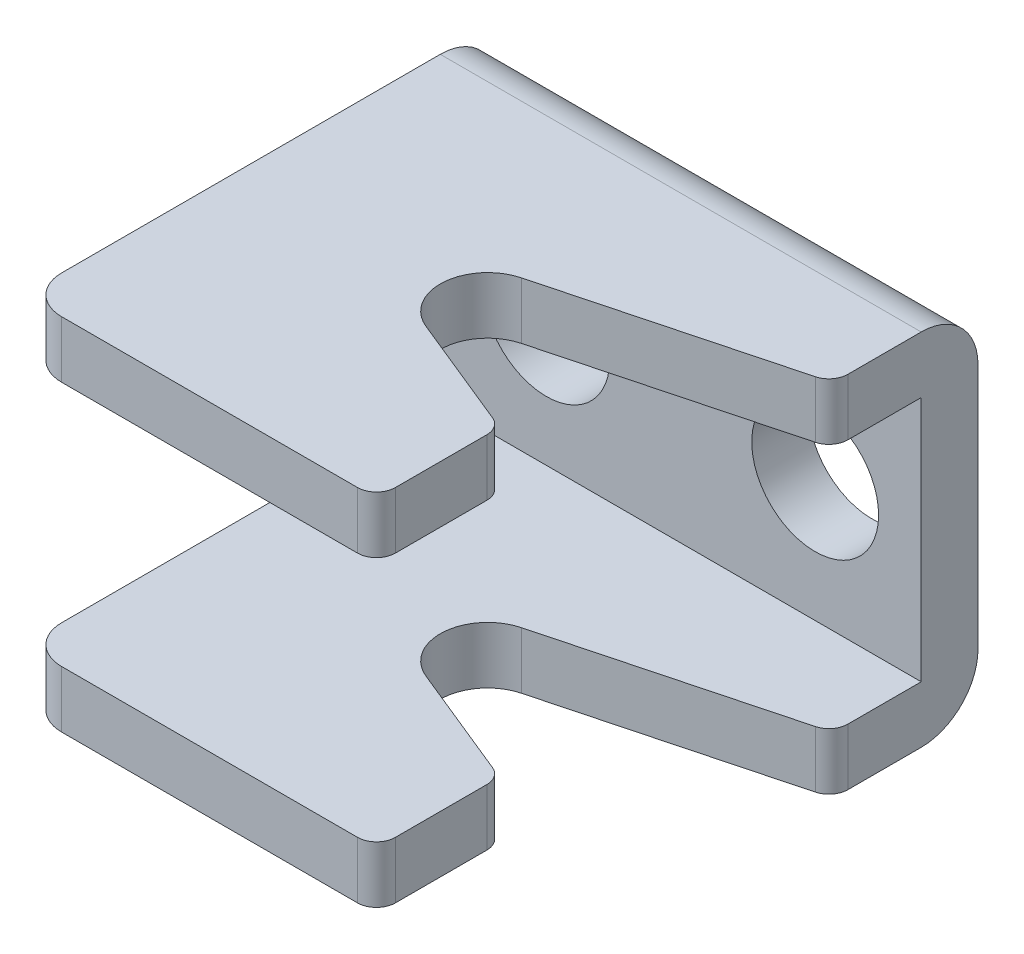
ISO-10303-21;
HEADER;
FILE_DESCRIPTION(('STEP AP214'),'2;1');
FILE_NAME('part.step','',(''),(''),'','','');
FILE_SCHEMA(('AUTOMOTIVE_DESIGN { 1 0 10303 214 1 1 1 1 }'));
ENDSEC;
DATA;
#1=APPLICATION_CONTEXT('core data for automotive mechanical design processes');
#2=APPLICATION_PROTOCOL_DEFINITION('international standard','automotive_design',2000,#1);
#3=PRODUCT_CONTEXT('',#1,'mechanical');
#4=PRODUCT('Part','Part','',(#3));
#5=PRODUCT_RELATED_PRODUCT_CATEGORY('part','',(#4));
#6=PRODUCT_DEFINITION_FORMATION('','',#4);
#7=PRODUCT_DEFINITION_CONTEXT('part definition',#1,'design');
#8=PRODUCT_DEFINITION('design','',#6,#7);
#9=PRODUCT_DEFINITION_SHAPE('','',#8);
#10=(LENGTH_UNIT() NAMED_UNIT(*) SI_UNIT(.MILLI.,.METRE.));
#11=(NAMED_UNIT(*) PLANE_ANGLE_UNIT() SI_UNIT($,.RADIAN.));
#12=(NAMED_UNIT(*) SI_UNIT($,.STERADIAN.) SOLID_ANGLE_UNIT());
#13=UNCERTAINTY_MEASURE_WITH_UNIT(LENGTH_MEASURE(1.E-05),#10,'distance_accuracy_value','');
#14=(GEOMETRIC_REPRESENTATION_CONTEXT(3) GLOBAL_UNCERTAINTY_ASSIGNED_CONTEXT((#13)) GLOBAL_UNIT_ASSIGNED_CONTEXT((#10,
#11,#12)) REPRESENTATION_CONTEXT('',''));
#15=CARTESIAN_POINT('',(0.,0.,0.));
#16=DIRECTION('',(0.,0.,1.));
#17=DIRECTION('',(1.,0.,0.));
#18=AXIS2_PLACEMENT_3D('',#15,#16,#17);
#19=CARTESIAN_POINT('',(12.03,-6.49999999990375,23.9999999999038));
#20=DIRECTION('',(0.,-1.,0.));
#21=DIRECTION('',(0.,0.,-1.));
#22=AXIS2_PLACEMENT_3D('',#19,#20,#21);
#23=CYLINDRICAL_SURFACE('',#22,1.);
#24=CARTESIAN_POINT('',(12.03,-9.49999999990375,23.9999999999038));
#25=DIRECTION('',(0.,-1.,0.));
#26=DIRECTION('',(0.,0.,-1.));
#27=AXIS2_PLACEMENT_3D('',#24,#25,#26);
#28=CIRCLE('',#27,1.);
#29=CARTESIAN_POINT('',(12.03,-9.49999999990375,24.9999999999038));
#30=VERTEX_POINT('',#29);
#31=CARTESIAN_POINT('',(13.03,-9.49999999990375,23.9999999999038));
#32=VERTEX_POINT('',#31);
#33=EDGE_CURVE('E180',#30,#32,#28,.F.);
#34=ORIENTED_EDGE('',*,*,#33,.T.);
#35=DIRECTION('',(0.,1.,0.));
#36=VECTOR('',#35,1.);
#37=CARTESIAN_POINT('',(13.03,-6.49999999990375,23.9999999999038));
#38=LINE('',#37,#36);
#39=CARTESIAN_POINT('',(13.03,-6.49999999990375,23.9999999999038));
#40=VERTEX_POINT('',#39);
#41=EDGE_CURVE('E178',#32,#40,#38,.T.);
#42=ORIENTED_EDGE('',*,*,#41,.T.);
#43=CARTESIAN_POINT('',(12.03,-6.49999999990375,23.9999999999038));
#44=DIRECTION('',(0.,-1.,0.));
#45=DIRECTION('',(0.,0.,-1.));
#46=AXIS2_PLACEMENT_3D('',#43,#44,#45);
#47=CIRCLE('',#46,1.);
#48=CARTESIAN_POINT('',(12.03,-6.49999999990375,24.9999999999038));
#49=VERTEX_POINT('',#48);
#50=EDGE_CURVE('E17',#40,#49,#47,.T.);
#51=ORIENTED_EDGE('',*,*,#50,.T.);
#52=DIRECTION('',(0.,1.,0.));
#53=VECTOR('',#52,1.);
#54=CARTESIAN_POINT('',(12.03,-6.49999999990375,24.9999999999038));
#55=LINE('',#54,#53);
#56=EDGE_CURVE('E175',#49,#30,#55,.F.);
#57=ORIENTED_EDGE('',*,*,#56,.T.);
#58=EDGE_LOOP('',(#34,#42,#51,#57));
#59=FACE_BOUND('',#58,.T.);
#60=ADVANCED_FACE('F14',(#59),#23,.T.);
#61=CARTESIAN_POINT('',(12.03,-6.49999999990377,19.1717565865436));
#62=DIRECTION('',(0.,-1.,0.));
#63=DIRECTION('',(0.,0.,-1.));
#64=AXIS2_PLACEMENT_3D('',#61,#62,#63);
#65=CYLINDRICAL_SURFACE('',#64,1.);
#66=CARTESIAN_POINT('',(12.03,-9.49999999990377,19.1717565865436));
#67=DIRECTION('',(0.,-1.,0.));
#68=DIRECTION('',(0.,0.,-1.));
#69=AXIS2_PLACEMENT_3D('',#66,#67,#68);
#70=CIRCLE('',#69,1.);
#71=CARTESIAN_POINT('',(13.03,-9.49999999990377,19.1717565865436));
#72=VERTEX_POINT('',#71);
#73=CARTESIAN_POINT('',(12.4081157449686,-9.49999999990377,18.245998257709));
#74=VERTEX_POINT('',#73);
#75=EDGE_CURVE('E187',#72,#74,#70,.F.);
#76=ORIENTED_EDGE('',*,*,#75,.T.);
#77=DIRECTION('',(0.,1.,0.));
#78=VECTOR('',#77,1.);
#79=CARTESIAN_POINT('',(12.4081157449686,-6.49999999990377,18.245998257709));
#80=LINE('',#79,#78);
#81=CARTESIAN_POINT('',(12.4081157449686,-6.49999999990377,18.245998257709));
#82=VERTEX_POINT('',#81);
#83=EDGE_CURVE('E279',#74,#82,#80,.T.);
#84=ORIENTED_EDGE('',*,*,#83,.T.);
#85=CARTESIAN_POINT('',(12.03,-6.49999999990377,19.1717565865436));
#86=DIRECTION('',(0.,-1.,0.));
#87=DIRECTION('',(0.,0.,-1.));
#88=AXIS2_PLACEMENT_3D('',#85,#86,#87);
#89=CIRCLE('',#88,1.);
#90=CARTESIAN_POINT('',(13.03,-6.49999999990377,19.1717565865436));
#91=VERTEX_POINT('',#90);
#92=EDGE_CURVE('E350',#82,#91,#89,.T.);
#93=ORIENTED_EDGE('',*,*,#92,.T.);
#94=DIRECTION('',(0.,1.,0.));
#95=VECTOR('',#94,1.);
#96=CARTESIAN_POINT('',(13.03,-6.49999999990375,19.1717565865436));
#97=LINE('',#96,#95);
#98=EDGE_CURVE('E282',#91,#72,#97,.F.);
#99=ORIENTED_EDGE('',*,*,#98,.T.);
#100=EDGE_LOOP('',(#76,#84,#93,#99));
#101=FACE_BOUND('',#100,.T.);
#102=ADVANCED_FACE('F561',(#101),#65,.T.);
#103=CARTESIAN_POINT('',(-3.6,-6.49999999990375,24.9999999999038));
#104=DIRECTION('',(0.,0.,-1.));
#105=DIRECTION('',(0.,1.,0.));
#106=AXIS2_PLACEMENT_3D('',#103,#104,#105);
#107=PLANE('',#106);
#108=DIRECTION('',(1.,0.,0.));
#109=VECTOR('',#108,1.);
#110=CARTESIAN_POINT('',(7.4,-6.49999999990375,24.9999999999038));
#111=LINE('',#110,#109);
#112=CARTESIAN_POINT('',(-3.6,-6.49999999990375,24.9999999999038));
#113=VERTEX_POINT('',#112);
#114=EDGE_CURVE('E183',#113,#49,#111,.T.);
#115=ORIENTED_EDGE('',*,*,#114,.F.);
#116=DIRECTION('',(0.,-1.,0.));
#117=VECTOR('',#116,1.);
#118=CARTESIAN_POINT('',(-3.6,-6.49999999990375,24.9999999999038));
#119=LINE('',#118,#117);
#120=CARTESIAN_POINT('',(-3.6,-9.49999999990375,24.9999999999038));
#121=VERTEX_POINT('',#120);
#122=EDGE_CURVE('E286',#121,#113,#119,.F.);
#123=ORIENTED_EDGE('',*,*,#122,.F.);
#124=DIRECTION('',(1.,0.,0.));
#125=VECTOR('',#124,1.);
#126=CARTESIAN_POINT('',(7.4,-9.49999999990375,24.9999999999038));
#127=LINE('',#126,#125);
#128=EDGE_CURVE('E186',#121,#30,#127,.T.);
#129=ORIENTED_EDGE('',*,*,#128,.T.);
#130=ORIENTED_EDGE('',*,*,#56,.F.);
#131=EDGE_LOOP('',(#115,#123,#129,#130));
#132=FACE_BOUND('',#131,.T.);
#133=ADVANCED_FACE('F182',(#132),#107,.F.);
#134=CARTESIAN_POINT('',(13.03,-6.49999999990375,23.9999999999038));
#135=DIRECTION('',(-1.,0.,0.));
#136=DIRECTION('',(0.,0.,1.));
#137=AXIS2_PLACEMENT_3D('',#134,#135,#136);
#138=PLANE('',#137);
#139=DIRECTION('',(0.,0.,1.));
#140=VECTOR('',#139,1.);
#141=CARTESIAN_POINT('',(13.03,-6.49999999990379,13.4999999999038));
#142=LINE('',#141,#140);
#143=EDGE_CURVE('E193',#40,#91,#142,.F.);
#144=ORIENTED_EDGE('',*,*,#143,.F.);
#145=ORIENTED_EDGE('',*,*,#41,.F.);
#146=DIRECTION('',(0.,0.,1.));
#147=VECTOR('',#146,1.);
#148=CARTESIAN_POINT('',(13.03,-9.49999999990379,13.4999999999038));
#149=LINE('',#148,#147);
#150=EDGE_CURVE('E357',#32,#72,#149,.F.);
#151=ORIENTED_EDGE('',*,*,#150,.T.);
#152=ORIENTED_EDGE('',*,*,#98,.F.);
#153=EDGE_LOOP('',(#144,#145,#151,#152));
#154=FACE_BOUND('',#153,.T.);
#155=ADVANCED_FACE('F355',(#154),#138,.F.);
#156=CARTESIAN_POINT('',(12.4081157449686,-6.49999999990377,18.245998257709));
#157=DIRECTION('',(-0.378115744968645,0.,0.925758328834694));
#158=DIRECTION('',(0.925758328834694,0.,0.378115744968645));
#159=AXIS2_PLACEMENT_3D('',#156,#157,#158);
#160=PLANE('',#159);
#161=DIRECTION('',(-0.925758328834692,0.,-0.37811574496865));
#162=VECTOR('',#161,1.);
#163=CARTESIAN_POINT('',(12.4081157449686,-6.49999999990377,18.245998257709));
#164=LINE('',#163,#162);
#165=CARTESIAN_POINT('',(6.45471063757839,-6.49999999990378,15.8143958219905));
#166=VERTEX_POINT('',#165);
#167=EDGE_CURVE('E196',#82,#166,#164,.T.);
#168=ORIENTED_EDGE('',*,*,#167,.F.);
#169=ORIENTED_EDGE('',*,*,#83,.F.);
#170=DIRECTION('',(-0.925758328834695,0.,-0.378115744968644));
#171=VECTOR('',#170,1.);
#172=CARTESIAN_POINT('',(12.4081157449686,-9.49999999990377,18.245998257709));
#173=LINE('',#172,#171);
#174=CARTESIAN_POINT('',(6.45471063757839,-9.49999999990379,15.8143958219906));
#175=VERTEX_POINT('',#174);
#176=EDGE_CURVE('E326',#74,#175,#173,.T.);
#177=ORIENTED_EDGE('',*,*,#176,.T.);
#178=DIRECTION('',(0.,-1.,0.));
#179=VECTOR('',#178,1.);
#180=CARTESIAN_POINT('',(6.4547106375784,-6.49999999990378,15.8143958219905));
#181=LINE('',#180,#179);
#182=EDGE_CURVE('E276',#175,#166,#181,.F.);
#183=ORIENTED_EDGE('',*,*,#182,.T.);
#184=EDGE_LOOP('',(#168,#169,#177,#183));
#185=FACE_BOUND('',#184,.T.);
#186=ADVANCED_FACE('F379',(#185),#160,.F.);
#187=CARTESIAN_POINT('',(7.4,-6.49999999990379,13.4999999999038));
#188=DIRECTION('',(0.,-1.,0.));
#189=DIRECTION('',(0.,0.,-1.));
#190=AXIS2_PLACEMENT_3D('',#187,#188,#189);
#191=CYLINDRICAL_SURFACE('',#190,2.5);
#192=CARTESIAN_POINT('',(7.4,-6.49999999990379,13.4999999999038));
#193=DIRECTION('',(0.,-1.,0.));
#194=DIRECTION('',(0.,0.,-1.));
#195=AXIS2_PLACEMENT_3D('',#192,#193,#194);
#196=CIRCLE('',#195,2.5);
#197=CARTESIAN_POINT('',(6.76239335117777,-6.4999999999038,11.0826754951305));
#198=VERTEX_POINT('',#197);
#199=EDGE_CURVE('E331',#166,#198,#196,.T.);
#200=ORIENTED_EDGE('',*,*,#199,.F.);
#201=ORIENTED_EDGE('',*,*,#182,.F.);
#202=CARTESIAN_POINT('',(7.4,-9.49999999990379,13.4999999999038));
#203=DIRECTION('',(0.,-1.,0.));
#204=DIRECTION('',(0.,0.,-1.));
#205=AXIS2_PLACEMENT_3D('',#202,#203,#204);
#206=CIRCLE('',#205,2.5);
#207=CARTESIAN_POINT('',(6.76239335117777,-9.4999999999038,11.0826754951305));
#208=VERTEX_POINT('',#207);
#209=EDGE_CURVE('E323',#175,#208,#206,.T.);
#210=ORIENTED_EDGE('',*,*,#209,.T.);
#211=DIRECTION('',(0.,1.,0.));
#212=VECTOR('',#211,1.);
#213=CARTESIAN_POINT('',(6.76239335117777,-6.4999999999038,11.0826754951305));
#214=LINE('',#213,#212);
#215=EDGE_CURVE('E274',#208,#198,#214,.T.);
#216=ORIENTED_EDGE('',*,*,#215,.T.);
#217=EDGE_LOOP('',(#200,#201,#210,#216));
#218=FACE_BOUND('',#217,.T.);
#219=ADVANCED_FACE('F382',(#218),#191,.F.);
#220=CARTESIAN_POINT('',(6.76239335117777,-6.4999999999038,11.0826754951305));
#221=DIRECTION('',(-0.255042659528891,0.,-0.966929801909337));
#222=DIRECTION('',(-0.966929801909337,0.,0.255042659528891));
#223=AXIS2_PLACEMENT_3D('',#220,#221,#222);
#224=PLANE('',#223);
#225=DIRECTION('',(0.966929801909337,0.,-0.255042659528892));
#226=VECTOR('',#225,1.);
#227=CARTESIAN_POINT('',(6.76239335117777,-6.4999999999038,11.0826754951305));
#228=LINE('',#227,#226);
#229=CARTESIAN_POINT('',(19.0550426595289,-6.49999999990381,7.84029950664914));
#230=VERTEX_POINT('',#229);
#231=EDGE_CURVE('E203',#198,#230,#228,.T.);
#232=ORIENTED_EDGE('',*,*,#231,.F.);
#233=ORIENTED_EDGE('',*,*,#215,.F.);
#234=DIRECTION('',(0.966929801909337,0.,-0.255042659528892));
#235=VECTOR('',#234,1.);
#236=CARTESIAN_POINT('',(6.76239335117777,-9.4999999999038,11.0826754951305));
#237=LINE('',#236,#235);
#238=CARTESIAN_POINT('',(19.0550426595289,-9.49999999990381,7.84029950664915));
#239=VERTEX_POINT('',#238);
#240=EDGE_CURVE('E322',#208,#239,#237,.T.);
#241=ORIENTED_EDGE('',*,*,#240,.T.);
#242=DIRECTION('',(0.,-1.,0.));
#243=VECTOR('',#242,1.);
#244=CARTESIAN_POINT('',(19.0550426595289,-6.49999999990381,7.84029950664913));
#245=LINE('',#244,#243);
#246=EDGE_CURVE('E271',#230,#239,#245,.T.);
#247=ORIENTED_EDGE('',*,*,#246,.F.);
#248=EDGE_LOOP('',(#232,#233,#241,#247));
#249=FACE_BOUND('',#248,.T.);
#250=ADVANCED_FACE('F386',(#249),#224,.F.);
#251=CARTESIAN_POINT('',(14.2,0.,3.));
#252=DIRECTION('',(0.,0.,1.));
#253=DIRECTION('',(1.,0.,0.));
#254=AXIS2_PLACEMENT_3D('',#251,#252,#253);
#255=CYLINDRICAL_SURFACE('',#254,3.35);
#256=CARTESIAN_POINT('',(14.2,0.,0.));
#257=DIRECTION('',(0.,0.,1.));
#258=DIRECTION('',(1.,0.,0.));
#259=AXIS2_PLACEMENT_3D('',#256,#257,#258);
#260=CIRCLE('',#259,3.35);
#261=CARTESIAN_POINT('',(17.55,0.,0.));
#262=VERTEX_POINT('',#261);
#263=EDGE_CURVE('E229',#262,#262,#260,.F.);
#264=ORIENTED_EDGE('',*,*,#263,.T.);
#265=EDGE_LOOP('',(#264));
#266=FACE_BOUND('',#265,.T.);
#267=CARTESIAN_POINT('',(14.2,0.,3.));
#268=DIRECTION('',(0.,0.,1.));
#269=DIRECTION('',(1.,0.,0.));
#270=AXIS2_PLACEMENT_3D('',#267,#268,#269);
#271=CIRCLE('',#270,3.35);
#272=CARTESIAN_POINT('',(17.55,0.,3.));
#273=VERTEX_POINT('',#272);
#274=EDGE_CURVE('E218',#273,#273,#271,.F.);
#275=ORIENTED_EDGE('',*,*,#274,.F.);
#276=EDGE_LOOP('',(#275));
#277=FACE_BOUND('',#276,.T.);
#278=ADVANCED_FACE('F547',(#266,#277),#255,.F.);
#279=CARTESIAN_POINT('',(0.,0.,3.));
#280=DIRECTION('',(0.,0.,1.));
#281=DIRECTION('',(1.,0.,0.));
#282=AXIS2_PLACEMENT_3D('',#279,#280,#281);
#283=CYLINDRICAL_SURFACE('',#282,3.35);
#284=CARTESIAN_POINT('',(0.,0.,0.));
#285=DIRECTION('',(0.,0.,1.));
#286=DIRECTION('',(1.,0.,0.));
#287=AXIS2_PLACEMENT_3D('',#284,#285,#286);
#288=CIRCLE('',#287,3.35);
#289=CARTESIAN_POINT('',(3.35,0.,0.));
#290=VERTEX_POINT('',#289);
#291=EDGE_CURVE('E263',#290,#290,#288,.F.);
#292=ORIENTED_EDGE('',*,*,#291,.T.);
#293=EDGE_LOOP('',(#292));
#294=FACE_BOUND('',#293,.T.);
#295=CARTESIAN_POINT('',(0.,0.,3.));
#296=DIRECTION('',(0.,0.,1.));
#297=DIRECTION('',(1.,0.,0.));
#298=AXIS2_PLACEMENT_3D('',#295,#296,#297);
#299=CIRCLE('',#298,3.35);
#300=CARTESIAN_POINT('',(3.35,0.,3.));
#301=VERTEX_POINT('',#300);
#302=EDGE_CURVE('E204',#301,#301,#299,.F.);
#303=ORIENTED_EDGE('',*,*,#302,.F.);
#304=EDGE_LOOP('',(#303));
#305=FACE_BOUND('',#304,.T.);
#306=ADVANCED_FACE('F543',(#294,#305),#283,.F.);
#307=CARTESIAN_POINT('',(18.8,-6.49999999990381,6.8733697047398));
#308=DIRECTION('',(0.,-1.,0.));
#309=DIRECTION('',(0.,0.,-1.));
#310=AXIS2_PLACEMENT_3D('',#307,#308,#309);
#311=CYLINDRICAL_SURFACE('',#310,1.);
#312=CARTESIAN_POINT('',(18.8,-9.49999999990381,6.87336970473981));
#313=DIRECTION('',(0.,-1.,0.));
#314=DIRECTION('',(0.,0.,-1.));
#315=AXIS2_PLACEMENT_3D('',#312,#313,#314);
#316=CIRCLE('',#315,1.);
#317=CARTESIAN_POINT('',(19.8,-9.49999999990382,6.87336970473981));
#318=VERTEX_POINT('',#317);
#319=EDGE_CURVE('E230',#239,#318,#316,.F.);
#320=ORIENTED_EDGE('',*,*,#319,.T.);
#321=DIRECTION('',(0.,1.,0.));
#322=VECTOR('',#321,1.);
#323=CARTESIAN_POINT('',(19.8,-6.4999999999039,6.87336970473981));
#324=LINE('',#323,#322);
#325=CARTESIAN_POINT('',(19.8,-6.49999999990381,6.8733697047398));
#326=VERTEX_POINT('',#325);
#327=EDGE_CURVE('E250',#318,#326,#324,.T.);
#328=ORIENTED_EDGE('',*,*,#327,.T.);
#329=CARTESIAN_POINT('',(18.8,-6.49999999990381,6.8733697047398));
#330=DIRECTION('',(0.,-1.,0.));
#331=DIRECTION('',(0.,0.,-1.));
#332=AXIS2_PLACEMENT_3D('',#329,#330,#331);
#333=CIRCLE('',#332,1.);
#334=EDGE_CURVE('E199',#230,#326,#333,.F.);
#335=ORIENTED_EDGE('',*,*,#334,.F.);
#336=ORIENTED_EDGE('',*,*,#246,.T.);
#337=EDGE_LOOP('',(#320,#328,#335,#336));
#338=FACE_BOUND('',#337,.T.);
#339=ADVANCED_FACE('F540',(#338),#311,.T.);
#340=CARTESIAN_POINT('',(18.8,6.49999999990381,6.8733697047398));
#341=DIRECTION('',(0.,1.,0.));
#342=DIRECTION('',(0.,0.,1.));
#343=AXIS2_PLACEMENT_3D('',#340,#341,#342);
#344=CYLINDRICAL_SURFACE('',#343,1.);
#345=CARTESIAN_POINT('',(18.8,9.49999999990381,6.87336970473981));
#346=DIRECTION('',(0.,1.,0.));
#347=DIRECTION('',(0.,0.,1.));
#348=AXIS2_PLACEMENT_3D('',#345,#346,#347);
#349=CIRCLE('',#348,1.);
#350=CARTESIAN_POINT('',(19.8,9.49999999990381,6.87336970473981));
#351=VERTEX_POINT('',#350);
#352=CARTESIAN_POINT('',(19.0550426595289,9.49999999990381,7.84029950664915));
#353=VERTEX_POINT('',#352);
#354=EDGE_CURVE('E273',#351,#353,#349,.F.);
#355=ORIENTED_EDGE('',*,*,#354,.T.);
#356=DIRECTION('',(0.,1.,0.));
#357=VECTOR('',#356,1.);
#358=CARTESIAN_POINT('',(19.0550426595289,6.4999999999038,7.84029950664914));
#359=LINE('',#358,#357);
#360=CARTESIAN_POINT('',(19.0550426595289,6.49999999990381,7.84029950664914));
#361=VERTEX_POINT('',#360);
#362=EDGE_CURVE('E249',#353,#361,#359,.F.);
#363=ORIENTED_EDGE('',*,*,#362,.T.);
#364=CARTESIAN_POINT('',(18.8,6.49999999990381,6.8733697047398));
#365=DIRECTION('',(0.,1.,0.));
#366=DIRECTION('',(0.,0.,1.));
#367=AXIS2_PLACEMENT_3D('',#364,#365,#366);
#368=CIRCLE('',#367,1.);
#369=CARTESIAN_POINT('',(19.8,6.49999999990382,6.8733697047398));
#370=VERTEX_POINT('',#369);
#371=EDGE_CURVE('E342',#370,#361,#368,.F.);
#372=ORIENTED_EDGE('',*,*,#371,.F.);
#373=DIRECTION('',(0.,1.,0.));
#374=VECTOR('',#373,1.);
#375=CARTESIAN_POINT('',(19.8,-6.4999999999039,6.87336970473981));
#376=LINE('',#375,#374);
#377=EDGE_CURVE('E268',#370,#351,#376,.T.);
#378=ORIENTED_EDGE('',*,*,#377,.T.);
#379=EDGE_LOOP('',(#355,#363,#372,#378));
#380=FACE_BOUND('',#379,.T.);
#381=ADVANCED_FACE('F476',(#380),#344,.T.);
#382=CARTESIAN_POINT('',(12.03,6.49999999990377,19.1717565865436));
#383=DIRECTION('',(0.,1.,0.));
#384=DIRECTION('',(0.,0.,1.));
#385=AXIS2_PLACEMENT_3D('',#382,#383,#384);
#386=CYLINDRICAL_SURFACE('',#385,1.);
#387=CARTESIAN_POINT('',(12.03,9.49999999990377,19.1717565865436));
#388=DIRECTION('',(0.,1.,0.));
#389=DIRECTION('',(0.,0.,1.));
#390=AXIS2_PLACEMENT_3D('',#387,#388,#389);
#391=CIRCLE('',#390,1.);
#392=CARTESIAN_POINT('',(12.4081157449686,9.49999999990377,18.245998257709));
#393=VERTEX_POINT('',#392);
#394=CARTESIAN_POINT('',(13.03,9.49999999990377,19.1717565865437));
#395=VERTEX_POINT('',#394);
#396=EDGE_CURVE('E346',#393,#395,#391,.F.);
#397=ORIENTED_EDGE('',*,*,#396,.T.);
#398=DIRECTION('',(0.,1.,0.));
#399=VECTOR('',#398,1.);
#400=CARTESIAN_POINT('',(13.03,6.49999999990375,19.1717565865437));
#401=LINE('',#400,#399);
#402=CARTESIAN_POINT('',(13.03,6.49999999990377,19.1717565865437));
#403=VERTEX_POINT('',#402);
#404=EDGE_CURVE('E240',#395,#403,#401,.F.);
#405=ORIENTED_EDGE('',*,*,#404,.T.);
#406=CARTESIAN_POINT('',(12.03,6.49999999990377,19.1717565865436));
#407=DIRECTION('',(0.,1.,0.));
#408=DIRECTION('',(0.,0.,1.));
#409=AXIS2_PLACEMENT_3D('',#406,#407,#408);
#410=CIRCLE('',#409,1.);
#411=CARTESIAN_POINT('',(12.4081157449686,6.49999999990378,18.2459982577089));
#412=VERTEX_POINT('',#411);
#413=EDGE_CURVE('E340',#412,#403,#410,.F.);
#414=ORIENTED_EDGE('',*,*,#413,.F.);
#415=DIRECTION('',(0.,1.,0.));
#416=VECTOR('',#415,1.);
#417=CARTESIAN_POINT('',(12.4081157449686,6.49999999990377,18.2459982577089));
#418=LINE('',#417,#416);
#419=EDGE_CURVE('E244',#412,#393,#418,.T.);
#420=ORIENTED_EDGE('',*,*,#419,.T.);
#421=EDGE_LOOP('',(#397,#405,#414,#420));
#422=FACE_BOUND('',#421,.T.);
#423=ADVANCED_FACE('F457',(#422),#386,.T.);
#424=CARTESIAN_POINT('',(12.03,6.49999999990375,23.9999999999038));
#425=DIRECTION('',(0.,1.,0.));
#426=DIRECTION('',(0.,0.,1.));
#427=AXIS2_PLACEMENT_3D('',#424,#425,#426);
#428=CYLINDRICAL_SURFACE('',#427,1.);
#429=CARTESIAN_POINT('',(12.03,9.49999999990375,23.9999999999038));
#430=DIRECTION('',(0.,1.,0.));
#431=DIRECTION('',(0.,0.,1.));
#432=AXIS2_PLACEMENT_3D('',#429,#430,#431);
#433=CIRCLE('',#432,1.);
#434=CARTESIAN_POINT('',(13.03,9.49999999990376,23.9999999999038));
#435=VERTEX_POINT('',#434);
#436=CARTESIAN_POINT('',(12.03,9.49999999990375,24.9999999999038));
#437=VERTEX_POINT('',#436);
#438=EDGE_CURVE('E344',#435,#437,#433,.F.);
#439=ORIENTED_EDGE('',*,*,#438,.T.);
#440=DIRECTION('',(0.,1.,0.));
#441=VECTOR('',#440,1.);
#442=CARTESIAN_POINT('',(12.03,6.49999999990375,24.9999999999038));
#443=LINE('',#442,#441);
#444=CARTESIAN_POINT('',(12.03,6.49999999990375,24.9999999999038));
#445=VERTEX_POINT('',#444);
#446=EDGE_CURVE('E235',#437,#445,#443,.F.);
#447=ORIENTED_EDGE('',*,*,#446,.T.);
#448=CARTESIAN_POINT('',(12.03,6.49999999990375,23.9999999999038));
#449=DIRECTION('',(0.,1.,0.));
#450=DIRECTION('',(0.,0.,1.));
#451=AXIS2_PLACEMENT_3D('',#448,#449,#450);
#452=CIRCLE('',#451,1.);
#453=CARTESIAN_POINT('',(13.03,6.49999999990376,23.9999999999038));
#454=VERTEX_POINT('',#453);
#455=EDGE_CURVE('E219',#454,#445,#452,.F.);
#456=ORIENTED_EDGE('',*,*,#455,.F.);
#457=DIRECTION('',(0.,1.,0.));
#458=VECTOR('',#457,1.);
#459=CARTESIAN_POINT('',(13.03,6.49999999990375,23.9999999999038));
#460=LINE('',#459,#458);
#461=EDGE_CURVE('E239',#454,#435,#460,.T.);
#462=ORIENTED_EDGE('',*,*,#461,.T.);
#463=EDGE_LOOP('',(#439,#447,#456,#462));
#464=FACE_BOUND('',#463,.T.);
#465=ADVANCED_FACE('F451',(#464),#428,.T.);
#466=CARTESIAN_POINT('',(19.8,-6.49999999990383,3.));
#467=DIRECTION('',(1.,0.,0.));
#468=DIRECTION('',(0.,1.,0.));
#469=AXIS2_PLACEMENT_3D('',#466,#467,#468);
#470=CYLINDRICAL_SURFACE('',#469,3.);
#471=CARTESIAN_POINT('',(19.8,-6.49999999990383,3.));
#472=DIRECTION('',(1.,0.,0.));
#473=DIRECTION('',(0.,1.,0.));
#474=AXIS2_PLACEMENT_3D('',#471,#472,#473);
#475=CIRCLE('',#474,3.);
#476=CARTESIAN_POINT('',(19.8,-6.49999999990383,0.));
#477=VERTEX_POINT('',#476);
#478=CARTESIAN_POINT('',(19.8,-9.49999999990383,3.));
#479=VERTEX_POINT('',#478);
#480=EDGE_CURVE('E313',#477,#479,#475,.F.);
#481=ORIENTED_EDGE('',*,*,#480,.T.);
#482=DIRECTION('',(1.,0.,0.));
#483=VECTOR('',#482,1.);
#484=CARTESIAN_POINT('',(7.4,-9.49999999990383,3.));
#485=LINE('',#484,#483);
#486=CARTESIAN_POINT('',(-5.6,-9.49999999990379,3.));
#487=VERTEX_POINT('',#486);
#488=EDGE_CURVE('E288',#479,#487,#485,.F.);
#489=ORIENTED_EDGE('',*,*,#488,.T.);
#490=CARTESIAN_POINT('',(-5.6,-6.49999999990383,3.));
#491=DIRECTION('',(1.,0.,0.));
#492=DIRECTION('',(0.,1.,0.));
#493=AXIS2_PLACEMENT_3D('',#490,#491,#492);
#494=CIRCLE('',#493,3.);
#495=CARTESIAN_POINT('',(-5.6,-6.49999999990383,0.));
#496=VERTEX_POINT('',#495);
#497=EDGE_CURVE('E305',#487,#496,#494,.T.);
#498=ORIENTED_EDGE('',*,*,#497,.T.);
#499=DIRECTION('',(1.,0.,0.));
#500=VECTOR('',#499,1.);
#501=CARTESIAN_POINT('',(7.4,-6.49999999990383,0.));
#502=LINE('',#501,#500);
#503=EDGE_CURVE('E227',#496,#477,#502,.T.);
#504=ORIENTED_EDGE('',*,*,#503,.T.);
#505=EDGE_LOOP('',(#481,#489,#498,#504));
#506=FACE_BOUND('',#505,.T.);
#507=ADVANCED_FACE('F529',(#506),#470,.T.);
#508=CARTESIAN_POINT('',(7.4,6.49999999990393,-25.2123889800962));
#509=DIRECTION('',(0.,-1.,0.));
#510=DIRECTION('',(0.,0.,-1.));
#511=AXIS2_PLACEMENT_3D('',#508,#509,#510);
#512=PLANE('',#511);
#513=ORIENTED_EDGE('',*,*,#455,.T.);
#514=DIRECTION('',(1.,0.,0.));
#515=VECTOR('',#514,1.);
#516=CARTESIAN_POINT('',(-3.6,6.49999999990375,24.9999999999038));
#517=LINE('',#516,#515);
#518=CARTESIAN_POINT('',(-3.6,6.49999999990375,24.9999999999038));
#519=VERTEX_POINT('',#518);
#520=EDGE_CURVE('E231',#445,#519,#517,.F.);
#521=ORIENTED_EDGE('',*,*,#520,.T.);
#522=CARTESIAN_POINT('',(-3.6,6.49999999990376,22.9999999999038));
#523=DIRECTION('',(0.,1.,0.));
#524=DIRECTION('',(0.,0.,1.));
#525=AXIS2_PLACEMENT_3D('',#522,#523,#524);
#526=CIRCLE('',#525,2.);
#527=CARTESIAN_POINT('',(-5.6,6.49999999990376,22.9999999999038));
#528=VERTEX_POINT('',#527);
#529=EDGE_CURVE('E234',#528,#519,#526,.T.);
#530=ORIENTED_EDGE('',*,*,#529,.F.);
#531=DIRECTION('',(0.,0.,-1.));
#532=VECTOR('',#531,1.);
#533=CARTESIAN_POINT('',(-5.6,6.49999999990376,22.9999999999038));
#534=LINE('',#533,#532);
#535=CARTESIAN_POINT('',(-5.6,6.49999999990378,3.));
#536=VERTEX_POINT('',#535);
#537=EDGE_CURVE('E212',#528,#536,#534,.T.);
#538=ORIENTED_EDGE('',*,*,#537,.T.);
#539=DIRECTION('',(1.,0.,0.));
#540=VECTOR('',#539,1.);
#541=CARTESIAN_POINT('',(7.4,6.49999999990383,3.));
#542=LINE('',#541,#540);
#543=CARTESIAN_POINT('',(19.8,6.49999999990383,3.));
#544=VERTEX_POINT('',#543);
#545=EDGE_CURVE('E215',#544,#536,#542,.F.);
#546=ORIENTED_EDGE('',*,*,#545,.F.);
#547=DIRECTION('',(0.,0.,1.));
#548=VECTOR('',#547,1.);
#549=CARTESIAN_POINT('',(19.8,6.49999999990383,-18.5857586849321));
#550=LINE('',#549,#548);
#551=EDGE_CURVE('E262',#544,#370,#550,.T.);
#552=ORIENTED_EDGE('',*,*,#551,.T.);
#553=ORIENTED_EDGE('',*,*,#371,.T.);
#554=DIRECTION('',(-0.966929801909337,0.,0.255042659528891));
#555=VECTOR('',#554,1.);
#556=CARTESIAN_POINT('',(6.76239335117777,6.49999999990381,11.0826754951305));
#557=LINE('',#556,#555);
#558=CARTESIAN_POINT('',(6.76239335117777,6.49999999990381,11.0826754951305));
#559=VERTEX_POINT('',#558);
#560=EDGE_CURVE('E246',#361,#559,#557,.T.);
#561=ORIENTED_EDGE('',*,*,#560,.T.);
#562=CARTESIAN_POINT('',(7.4,6.49999999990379,13.4999999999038));
#563=DIRECTION('',(0.,1.,0.));
#564=DIRECTION('',(0.,0.,1.));
#565=AXIS2_PLACEMENT_3D('',#562,#563,#564);
#566=CIRCLE('',#565,2.5);
#567=CARTESIAN_POINT('',(6.4547106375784,6.49999999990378,15.8143958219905));
#568=VERTEX_POINT('',#567);
#569=EDGE_CURVE('E311',#559,#568,#566,.T.);
#570=ORIENTED_EDGE('',*,*,#569,.T.);
#571=DIRECTION('',(0.925758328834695,0.,0.378115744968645));
#572=VECTOR('',#571,1.);
#573=CARTESIAN_POINT('',(12.4081157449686,6.49999999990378,18.2459982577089));
#574=LINE('',#573,#572);
#575=EDGE_CURVE('E241',#568,#412,#574,.T.);
#576=ORIENTED_EDGE('',*,*,#575,.T.);
#577=ORIENTED_EDGE('',*,*,#413,.T.);
#578=DIRECTION('',(0.,0.,1.));
#579=VECTOR('',#578,1.);
#580=CARTESIAN_POINT('',(13.03,6.49999999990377,23.9999999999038));
#581=LINE('',#580,#579);
#582=EDGE_CURVE('E236',#403,#454,#581,.T.);
#583=ORIENTED_EDGE('',*,*,#582,.T.);
#584=EDGE_LOOP('',(#513,#521,#530,#538,#546,#552,#553,#561,#570,#576,#577,#583));
#585=FACE_BOUND('',#584,.T.);
#586=ADVANCED_FACE('F525',(#585),#512,.T.);
#587=CARTESIAN_POINT('',(7.4,-19.35619449,3.));
#588=DIRECTION('',(0.,0.,1.));
#589=DIRECTION('',(1.,0.,0.));
#590=AXIS2_PLACEMENT_3D('',#587,#588,#589);
#591=PLANE('',#590);
#592=ORIENTED_EDGE('',*,*,#302,.T.);
#593=EDGE_LOOP('',(#592));
#594=FACE_BOUND('',#593,.T.);
#595=ORIENTED_EDGE('',*,*,#274,.T.);
#596=EDGE_LOOP('',(#595));
#597=FACE_BOUND('',#596,.T.);
#598=DIRECTION('',(0.,1.,0.));
#599=VECTOR('',#598,1.);
#600=CARTESIAN_POINT('',(19.8,-6.4999999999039,3.));
#601=LINE('',#600,#599);
#602=CARTESIAN_POINT('',(19.8,-6.49999999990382,3.));
#603=VERTEX_POINT('',#602);
#604=EDGE_CURVE('E259',#603,#544,#601,.T.);
#605=ORIENTED_EDGE('',*,*,#604,.T.);
#606=ORIENTED_EDGE('',*,*,#545,.T.);
#607=DIRECTION('',(0.,1.,0.));
#608=VECTOR('',#607,1.);
#609=CARTESIAN_POINT('',(-5.6,-6.49999999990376,3.));
#610=LINE('',#609,#608);
#611=CARTESIAN_POINT('',(-5.6,-6.49999999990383,3.));
#612=VERTEX_POINT('',#611);
#613=EDGE_CURVE('E208',#536,#612,#610,.F.);
#614=ORIENTED_EDGE('',*,*,#613,.T.);
#615=DIRECTION('',(1.,0.,0.));
#616=VECTOR('',#615,1.);
#617=CARTESIAN_POINT('',(7.4,-6.49999999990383,3.));
#618=LINE('',#617,#616);
#619=EDGE_CURVE('E194',#603,#612,#618,.F.);
#620=ORIENTED_EDGE('',*,*,#619,.F.);
#621=EDGE_LOOP('',(#605,#606,#614,#620));
#622=FACE_BOUND('',#621,.T.);
#623=ADVANCED_FACE('F522',(#594,#597,#622),#591,.T.);
#624=CARTESIAN_POINT('',(7.4,-6.49999999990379,13.4999999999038));
#625=DIRECTION('',(0.,1.,0.));
#626=DIRECTION('',(0.,0.,1.));
#627=AXIS2_PLACEMENT_3D('',#624,#625,#626);
#628=PLANE('',#627);
#629=ORIENTED_EDGE('',*,*,#167,.T.);
#630=ORIENTED_EDGE('',*,*,#199,.T.);
#631=ORIENTED_EDGE('',*,*,#231,.T.);
#632=ORIENTED_EDGE('',*,*,#334,.T.);
#633=DIRECTION('',(0.,0.,1.));
#634=VECTOR('',#633,1.);
#635=CARTESIAN_POINT('',(19.8,-6.49999999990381,-18.5857586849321));
#636=LINE('',#635,#634);
#637=EDGE_CURVE('E253',#326,#603,#636,.F.);
#638=ORIENTED_EDGE('',*,*,#637,.T.);
#639=ORIENTED_EDGE('',*,*,#619,.T.);
#640=DIRECTION('',(0.,0.,-1.));
#641=VECTOR('',#640,1.);
#642=CARTESIAN_POINT('',(-5.6,-6.49999999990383,22.9999999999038));
#643=LINE('',#642,#641);
#644=CARTESIAN_POINT('',(-5.6,-6.49999999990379,22.9999999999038));
#645=VERTEX_POINT('',#644);
#646=EDGE_CURVE('E211',#612,#645,#643,.F.);
#647=ORIENTED_EDGE('',*,*,#646,.T.);
#648=CARTESIAN_POINT('',(-3.6,-6.49999999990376,22.9999999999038));
#649=DIRECTION('',(0.,-1.,0.));
#650=DIRECTION('',(0.,0.,-1.));
#651=AXIS2_PLACEMENT_3D('',#648,#649,#650);
#652=CIRCLE('',#651,2.);
#653=EDGE_CURVE('E192',#113,#645,#652,.T.);
#654=ORIENTED_EDGE('',*,*,#653,.F.);
#655=ORIENTED_EDGE('',*,*,#114,.T.);
#656=ORIENTED_EDGE('',*,*,#50,.F.);
#657=ORIENTED_EDGE('',*,*,#143,.T.);
#658=ORIENTED_EDGE('',*,*,#92,.F.);
#659=EDGE_LOOP('',(#629,#630,#631,#632,#638,#639,#647,#654,#655,#656,#657,#658));
#660=FACE_BOUND('',#659,.T.);
#661=ADVANCED_FACE('F190',(#660),#628,.T.);
#662=CARTESIAN_POINT('',(-3.6,-6.49999999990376,22.9999999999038));
#663=DIRECTION('',(0.,-1.,0.));
#664=DIRECTION('',(0.,0.,-1.));
#665=AXIS2_PLACEMENT_3D('',#662,#663,#664);
#666=CYLINDRICAL_SURFACE('',#665,2.);
#667=CARTESIAN_POINT('',(-3.6,-9.49999999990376,22.9999999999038));
#668=DIRECTION('',(0.,-1.,0.));
#669=DIRECTION('',(0.,0.,-1.));
#670=AXIS2_PLACEMENT_3D('',#667,#668,#669);
#671=CIRCLE('',#670,2.);
#672=CARTESIAN_POINT('',(-5.6,-9.49999999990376,22.9999999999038));
#673=VERTEX_POINT('',#672);
#674=EDGE_CURVE('E327',#673,#121,#671,.F.);
#675=ORIENTED_EDGE('',*,*,#674,.T.);
#676=ORIENTED_EDGE('',*,*,#122,.T.);
#677=ORIENTED_EDGE('',*,*,#653,.T.);
#678=DIRECTION('',(0.,1.,0.));
#679=VECTOR('',#678,1.);
#680=CARTESIAN_POINT('',(-5.6,-6.49999999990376,22.9999999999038));
#681=LINE('',#680,#679);
#682=EDGE_CURVE('E367',#645,#673,#681,.F.);
#683=ORIENTED_EDGE('',*,*,#682,.T.);
#684=EDGE_LOOP('',(#675,#676,#677,#683));
#685=FACE_BOUND('',#684,.T.);
#686=ADVANCED_FACE('F516',(#685),#666,.T.);
#687=CARTESIAN_POINT('',(7.4,-9.49999999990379,13.4999999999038));
#688=DIRECTION('',(0.,1.,0.));
#689=DIRECTION('',(0.,0.,1.));
#690=AXIS2_PLACEMENT_3D('',#687,#688,#689);
#691=PLANE('',#690);
#692=ORIENTED_EDGE('',*,*,#319,.F.);
#693=ORIENTED_EDGE('',*,*,#240,.F.);
#694=ORIENTED_EDGE('',*,*,#209,.F.);
#695=ORIENTED_EDGE('',*,*,#176,.F.);
#696=ORIENTED_EDGE('',*,*,#75,.F.);
#697=ORIENTED_EDGE('',*,*,#150,.F.);
#698=ORIENTED_EDGE('',*,*,#33,.F.);
#699=ORIENTED_EDGE('',*,*,#128,.F.);
#700=ORIENTED_EDGE('',*,*,#674,.F.);
#701=DIRECTION('',(0.,0.,-1.));
#702=VECTOR('',#701,1.);
#703=CARTESIAN_POINT('',(-5.6,-9.49999999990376,22.9999999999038));
#704=LINE('',#703,#702);
#705=EDGE_CURVE('E304',#673,#487,#704,.T.);
#706=ORIENTED_EDGE('',*,*,#705,.T.);
#707=ORIENTED_EDGE('',*,*,#488,.F.);
#708=DIRECTION('',(0.,0.,1.));
#709=VECTOR('',#708,1.);
#710=CARTESIAN_POINT('',(19.8,-9.49999999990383,-18.5857586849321));
#711=LINE('',#710,#709);
#712=EDGE_CURVE('E254',#479,#318,#711,.T.);
#713=ORIENTED_EDGE('',*,*,#712,.T.);
#714=EDGE_LOOP('',(#692,#693,#694,#695,#696,#697,#698,#699,#700,#706,#707,#713));
#715=FACE_BOUND('',#714,.T.);
#716=ADVANCED_FACE('F359',(#715),#691,.F.);
#717=CARTESIAN_POINT('',(7.4,-19.35619449,0.));
#718=DIRECTION('',(0.,0.,1.));
#719=DIRECTION('',(1.,0.,0.));
#720=AXIS2_PLACEMENT_3D('',#717,#718,#719);
#721=PLANE('',#720);
#722=ORIENTED_EDGE('',*,*,#291,.F.);
#723=EDGE_LOOP('',(#722));
#724=FACE_BOUND('',#723,.T.);
#725=ORIENTED_EDGE('',*,*,#263,.F.);
#726=EDGE_LOOP('',(#725));
#727=FACE_BOUND('',#726,.T.);
#728=ORIENTED_EDGE('',*,*,#503,.F.);
#729=DIRECTION('',(0.,1.,0.));
#730=VECTOR('',#729,1.);
#731=CARTESIAN_POINT('',(-5.6,-6.49999999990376,0.));
#732=LINE('',#731,#730);
#733=CARTESIAN_POINT('',(-5.6,6.49999999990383,0.));
#734=VERTEX_POINT('',#733);
#735=EDGE_CURVE('E308',#496,#734,#732,.T.);
#736=ORIENTED_EDGE('',*,*,#735,.T.);
#737=DIRECTION('',(-1.,0.,0.));
#738=VECTOR('',#737,1.);
#739=CARTESIAN_POINT('',(-5.6,6.49999999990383,0.));
#740=LINE('',#739,#738);
#741=CARTESIAN_POINT('',(19.8,6.49999999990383,0.));
#742=VERTEX_POINT('',#741);
#743=EDGE_CURVE('E300',#742,#734,#740,.T.);
#744=ORIENTED_EDGE('',*,*,#743,.F.);
#745=DIRECTION('',(0.,1.,0.));
#746=VECTOR('',#745,1.);
#747=CARTESIAN_POINT('',(19.8,-6.4999999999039,0.));
#748=LINE('',#747,#746);
#749=EDGE_CURVE('E316',#742,#477,#748,.F.);
#750=ORIENTED_EDGE('',*,*,#749,.T.);
#751=EDGE_LOOP('',(#728,#736,#744,#750));
#752=FACE_BOUND('',#751,.T.);
#753=ADVANCED_FACE('F510',(#724,#727,#752),#721,.F.);
#754=CARTESIAN_POINT('',(19.8,-6.4999999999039,-18.5857586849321));
#755=DIRECTION('',(-1.,0.,0.));
#756=DIRECTION('',(0.,0.,1.));
#757=AXIS2_PLACEMENT_3D('',#754,#755,#756);
#758=PLANE('',#757);
#759=ORIENTED_EDGE('',*,*,#327,.F.);
#760=ORIENTED_EDGE('',*,*,#712,.F.);
#761=ORIENTED_EDGE('',*,*,#480,.F.);
#762=ORIENTED_EDGE('',*,*,#749,.F.);
#763=CARTESIAN_POINT('',(19.8,6.49999999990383,3.));
#764=DIRECTION('',(-1.,0.,0.));
#765=DIRECTION('',(0.,0.,1.));
#766=AXIS2_PLACEMENT_3D('',#763,#764,#765);
#767=CIRCLE('',#766,3.);
#768=CARTESIAN_POINT('',(19.8,9.49999999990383,3.));
#769=VERTEX_POINT('',#768);
#770=EDGE_CURVE('E301',#769,#742,#767,.T.);
#771=ORIENTED_EDGE('',*,*,#770,.F.);
#772=DIRECTION('',(0.,0.,-1.));
#773=VECTOR('',#772,1.);
#774=CARTESIAN_POINT('',(19.8,9.49999999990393,-25.2123889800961));
#775=LINE('',#774,#773);
#776=EDGE_CURVE('E299',#769,#351,#775,.F.);
#777=ORIENTED_EDGE('',*,*,#776,.T.);
#778=ORIENTED_EDGE('',*,*,#377,.F.);
#779=ORIENTED_EDGE('',*,*,#551,.F.);
#780=ORIENTED_EDGE('',*,*,#604,.F.);
#781=ORIENTED_EDGE('',*,*,#637,.F.);
#782=EDGE_LOOP('',(#759,#760,#761,#762,#771,#777,#778,#779,#780,#781));
#783=FACE_BOUND('',#782,.T.);
#784=ADVANCED_FACE('F480',(#783),#758,.F.);
#785=CARTESIAN_POINT('',(6.76239335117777,6.4999999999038,11.0826754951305));
#786=DIRECTION('',(-0.255042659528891,0.,-0.966929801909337));
#787=DIRECTION('',(-0.966929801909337,0.,0.255042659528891));
#788=AXIS2_PLACEMENT_3D('',#785,#786,#787);
#789=PLANE('',#788);
#790=ORIENTED_EDGE('',*,*,#560,.F.);
#791=ORIENTED_EDGE('',*,*,#362,.F.);
#792=DIRECTION('',(-0.966929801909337,0.,0.255042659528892));
#793=VECTOR('',#792,1.);
#794=CARTESIAN_POINT('',(19.0550426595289,9.49999999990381,7.84029950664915));
#795=LINE('',#794,#793);
#796=CARTESIAN_POINT('',(6.76239335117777,9.4999999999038,11.0826754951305));
#797=VERTEX_POINT('',#796);
#798=EDGE_CURVE('E297',#353,#797,#795,.T.);
#799=ORIENTED_EDGE('',*,*,#798,.T.);
#800=DIRECTION('',(0.,1.,0.));
#801=VECTOR('',#800,1.);
#802=CARTESIAN_POINT('',(6.76239335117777,6.4999999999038,11.0826754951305));
#803=LINE('',#802,#801);
#804=EDGE_CURVE('E248',#797,#559,#803,.F.);
#805=ORIENTED_EDGE('',*,*,#804,.T.);
#806=EDGE_LOOP('',(#790,#791,#799,#805));
#807=FACE_BOUND('',#806,.T.);
#808=ADVANCED_FACE('F471',(#807),#789,.F.);
#809=CARTESIAN_POINT('',(7.4,6.49999999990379,13.4999999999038));
#810=DIRECTION('',(0.,1.,0.));
#811=DIRECTION('',(0.,0.,1.));
#812=AXIS2_PLACEMENT_3D('',#809,#810,#811);
#813=CYLINDRICAL_SURFACE('',#812,2.5);
#814=ORIENTED_EDGE('',*,*,#804,.F.);
#815=CARTESIAN_POINT('',(7.4,9.49999999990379,13.4999999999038));
#816=DIRECTION('',(0.,1.,0.));
#817=DIRECTION('',(0.,0.,1.));
#818=AXIS2_PLACEMENT_3D('',#815,#816,#817);
#819=CIRCLE('',#818,2.5);
#820=CARTESIAN_POINT('',(6.45471063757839,9.49999999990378,15.8143958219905));
#821=VERTEX_POINT('',#820);
#822=EDGE_CURVE('E293',#797,#821,#819,.T.);
#823=ORIENTED_EDGE('',*,*,#822,.T.);
#824=DIRECTION('',(0.,1.,0.));
#825=VECTOR('',#824,1.);
#826=CARTESIAN_POINT('',(6.45471063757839,6.49999999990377,15.8143958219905));
#827=LINE('',#826,#825);
#828=EDGE_CURVE('E245',#821,#568,#827,.F.);
#829=ORIENTED_EDGE('',*,*,#828,.T.);
#830=ORIENTED_EDGE('',*,*,#569,.F.);
#831=EDGE_LOOP('',(#814,#823,#829,#830));
#832=FACE_BOUND('',#831,.T.);
#833=ADVANCED_FACE('F466',(#832),#813,.F.);
#834=CARTESIAN_POINT('',(12.4081157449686,6.49999999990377,18.2459982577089));
#835=DIRECTION('',(-0.378115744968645,0.,0.925758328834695));
#836=DIRECTION('',(0.925758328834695,0.,0.378115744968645));
#837=AXIS2_PLACEMENT_3D('',#834,#835,#836);
#838=PLANE('',#837);
#839=ORIENTED_EDGE('',*,*,#575,.F.);
#840=ORIENTED_EDGE('',*,*,#828,.F.);
#841=DIRECTION('',(0.925758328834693,0.,0.37811574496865));
#842=VECTOR('',#841,1.);
#843=CARTESIAN_POINT('',(6.45471063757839,9.49999999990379,15.8143958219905));
#844=LINE('',#843,#842);
#845=EDGE_CURVE('E296',#821,#393,#844,.T.);
#846=ORIENTED_EDGE('',*,*,#845,.T.);
#847=ORIENTED_EDGE('',*,*,#419,.F.);
#848=EDGE_LOOP('',(#839,#840,#846,#847));
#849=FACE_BOUND('',#848,.T.);
#850=ADVANCED_FACE('F501',(#849),#838,.F.);
#851=CARTESIAN_POINT('',(13.03,6.49999999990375,23.9999999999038));
#852=DIRECTION('',(-1.,0.,0.));
#853=DIRECTION('',(0.,0.,1.));
#854=AXIS2_PLACEMENT_3D('',#851,#852,#853);
#855=PLANE('',#854);
#856=ORIENTED_EDGE('',*,*,#582,.F.);
#857=ORIENTED_EDGE('',*,*,#404,.F.);
#858=DIRECTION('',(0.,0.,-1.));
#859=VECTOR('',#858,1.);
#860=CARTESIAN_POINT('',(13.03,9.49999999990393,-25.2123889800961));
#861=LINE('',#860,#859);
#862=EDGE_CURVE('E424',#395,#435,#861,.F.);
#863=ORIENTED_EDGE('',*,*,#862,.T.);
#864=ORIENTED_EDGE('',*,*,#461,.F.);
#865=EDGE_LOOP('',(#856,#857,#863,#864));
#866=FACE_BOUND('',#865,.T.);
#867=ADVANCED_FACE('F455',(#866),#855,.F.);
#868=CARTESIAN_POINT('',(-3.6,6.49999999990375,24.9999999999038));
#869=DIRECTION('',(0.,0.,-1.));
#870=DIRECTION('',(0.,1.,0.));
#871=AXIS2_PLACEMENT_3D('',#868,#869,#870);
#872=PLANE('',#871);
#873=ORIENTED_EDGE('',*,*,#520,.F.);
#874=ORIENTED_EDGE('',*,*,#446,.F.);
#875=DIRECTION('',(1.,0.,0.));
#876=VECTOR('',#875,1.);
#877=CARTESIAN_POINT('',(7.4,9.49999999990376,24.9999999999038));
#878=LINE('',#877,#876);
#879=CARTESIAN_POINT('',(-3.6,9.49999999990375,24.9999999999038));
#880=VERTEX_POINT('',#879);
#881=EDGE_CURVE('E292',#437,#880,#878,.F.);
#882=ORIENTED_EDGE('',*,*,#881,.T.);
#883=DIRECTION('',(0.,1.,0.));
#884=VECTOR('',#883,1.);
#885=CARTESIAN_POINT('',(-3.6,6.49999999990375,24.9999999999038));
#886=LINE('',#885,#884);
#887=EDGE_CURVE('E309',#519,#880,#886,.T.);
#888=ORIENTED_EDGE('',*,*,#887,.F.);
#889=EDGE_LOOP('',(#873,#874,#882,#888));
#890=FACE_BOUND('',#889,.T.);
#891=ADVANCED_FACE('F446',(#890),#872,.F.);
#892=CARTESIAN_POINT('',(-3.6,6.49999999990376,22.9999999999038));
#893=DIRECTION('',(0.,1.,0.));
#894=DIRECTION('',(0.,0.,1.));
#895=AXIS2_PLACEMENT_3D('',#892,#893,#894);
#896=CYLINDRICAL_SURFACE('',#895,2.);
#897=CARTESIAN_POINT('',(-3.6,9.49999999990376,22.9999999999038));
#898=DIRECTION('',(0.,1.,0.));
#899=DIRECTION('',(0.,0.,1.));
#900=AXIS2_PLACEMENT_3D('',#897,#898,#899);
#901=CIRCLE('',#900,2.);
#902=CARTESIAN_POINT('',(-5.6,9.49999999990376,22.9999999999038));
#903=VERTEX_POINT('',#902);
#904=EDGE_CURVE('E289',#880,#903,#901,.F.);
#905=ORIENTED_EDGE('',*,*,#904,.T.);
#906=DIRECTION('',(0.,1.,0.));
#907=VECTOR('',#906,1.);
#908=CARTESIAN_POINT('',(-5.6,-6.49999999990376,22.9999999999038));
#909=LINE('',#908,#907);
#910=EDGE_CURVE('E224',#903,#528,#909,.F.);
#911=ORIENTED_EDGE('',*,*,#910,.T.);
#912=ORIENTED_EDGE('',*,*,#529,.T.);
#913=ORIENTED_EDGE('',*,*,#887,.T.);
#914=EDGE_LOOP('',(#905,#911,#912,#913));
#915=FACE_BOUND('',#914,.T.);
#916=ADVANCED_FACE('F441',(#915),#896,.T.);
#917=CARTESIAN_POINT('',(-5.6,-6.49999999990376,22.9999999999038));
#918=DIRECTION('',(1.,0.,0.));
#919=DIRECTION('',(0.,0.,-1.));
#920=AXIS2_PLACEMENT_3D('',#917,#918,#919);
#921=PLANE('',#920);
#922=ORIENTED_EDGE('',*,*,#682,.F.);
#923=ORIENTED_EDGE('',*,*,#646,.F.);
#924=ORIENTED_EDGE('',*,*,#613,.F.);
#925=ORIENTED_EDGE('',*,*,#537,.F.);
#926=ORIENTED_EDGE('',*,*,#910,.F.);
#927=DIRECTION('',(0.,0.,-1.));
#928=VECTOR('',#927,1.);
#929=CARTESIAN_POINT('',(-5.6,9.49999999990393,-25.2123889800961));
#930=LINE('',#929,#928);
#931=CARTESIAN_POINT('',(-5.6,9.49999999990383,3.));
#932=VERTEX_POINT('',#931);
#933=EDGE_CURVE('E23',#903,#932,#930,.T.);
#934=ORIENTED_EDGE('',*,*,#933,.T.);
#935=CARTESIAN_POINT('',(-5.6,6.49999999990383,3.));
#936=DIRECTION('',(-1.,0.,0.));
#937=DIRECTION('',(0.,0.,1.));
#938=AXIS2_PLACEMENT_3D('',#935,#936,#937);
#939=CIRCLE('',#938,3.);
#940=EDGE_CURVE('E31',#734,#932,#939,.F.);
#941=ORIENTED_EDGE('',*,*,#940,.F.);
#942=ORIENTED_EDGE('',*,*,#735,.F.);
#943=ORIENTED_EDGE('',*,*,#497,.F.);
#944=ORIENTED_EDGE('',*,*,#705,.F.);
#945=EDGE_LOOP('',(#922,#923,#924,#925,#926,#934,#941,#942,#943,#944));
#946=FACE_BOUND('',#945,.T.);
#947=ADVANCED_FACE('F433',(#946),#921,.F.);
#948=CARTESIAN_POINT('',(-5.6,6.49999999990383,3.));
#949=DIRECTION('',(-1.,0.,0.));
#950=DIRECTION('',(0.,0.,1.));
#951=AXIS2_PLACEMENT_3D('',#948,#949,#950);
#952=CYLINDRICAL_SURFACE('',#951,3.);
#953=ORIENTED_EDGE('',*,*,#940,.T.);
#954=DIRECTION('',(1.,0.,0.));
#955=VECTOR('',#954,1.);
#956=CARTESIAN_POINT('',(7.4,9.49999999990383,3.));
#957=LINE('',#956,#955);
#958=EDGE_CURVE('E9',#932,#769,#957,.T.);
#959=ORIENTED_EDGE('',*,*,#958,.T.);
#960=ORIENTED_EDGE('',*,*,#770,.T.);
#961=ORIENTED_EDGE('',*,*,#743,.T.);
#962=EDGE_LOOP('',(#953,#959,#960,#961));
#963=FACE_BOUND('',#962,.T.);
#964=ADVANCED_FACE('F483',(#963),#952,.T.);
#965=CARTESIAN_POINT('',(7.4,9.49999999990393,-25.2123889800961));
#966=DIRECTION('',(0.,-1.,0.));
#967=DIRECTION('',(0.,0.,-1.));
#968=AXIS2_PLACEMENT_3D('',#965,#966,#967);
#969=PLANE('',#968);
#970=ORIENTED_EDGE('',*,*,#933,.F.);
#971=ORIENTED_EDGE('',*,*,#904,.F.);
#972=ORIENTED_EDGE('',*,*,#881,.F.);
#973=ORIENTED_EDGE('',*,*,#438,.F.);
#974=ORIENTED_EDGE('',*,*,#862,.F.);
#975=ORIENTED_EDGE('',*,*,#396,.F.);
#976=ORIENTED_EDGE('',*,*,#845,.F.);
#977=ORIENTED_EDGE('',*,*,#822,.F.);
#978=ORIENTED_EDGE('',*,*,#798,.F.);
#979=ORIENTED_EDGE('',*,*,#354,.F.);
#980=ORIENTED_EDGE('',*,*,#776,.F.);
#981=ORIENTED_EDGE('',*,*,#958,.F.);
#982=EDGE_LOOP('',(#970,#971,#972,#973,#974,#975,#976,#977,#978,#979,#980,#981));
#983=FACE_BOUND('',#982,.T.);
#984=ADVANCED_FACE('F438',(#983),#969,.F.);
#985=CLOSED_SHELL('',(#60,#102,#133,#155,#186,#219,#250,#278,#306,#339,#381,#423,#465,#507,#586,
#623,#661,#686,#716,#753,#784,#808,#833,#850,#867,#891,#916,#947,#964,#984));
#986=MANIFOLD_SOLID_BREP('B1',#985);
#987=ADVANCED_BREP_SHAPE_REPRESENTATION('',(#18,#986),#14);
#988=SHAPE_DEFINITION_REPRESENTATION(#9,#987);
ENDSEC;
END-ISO-10303-21;
